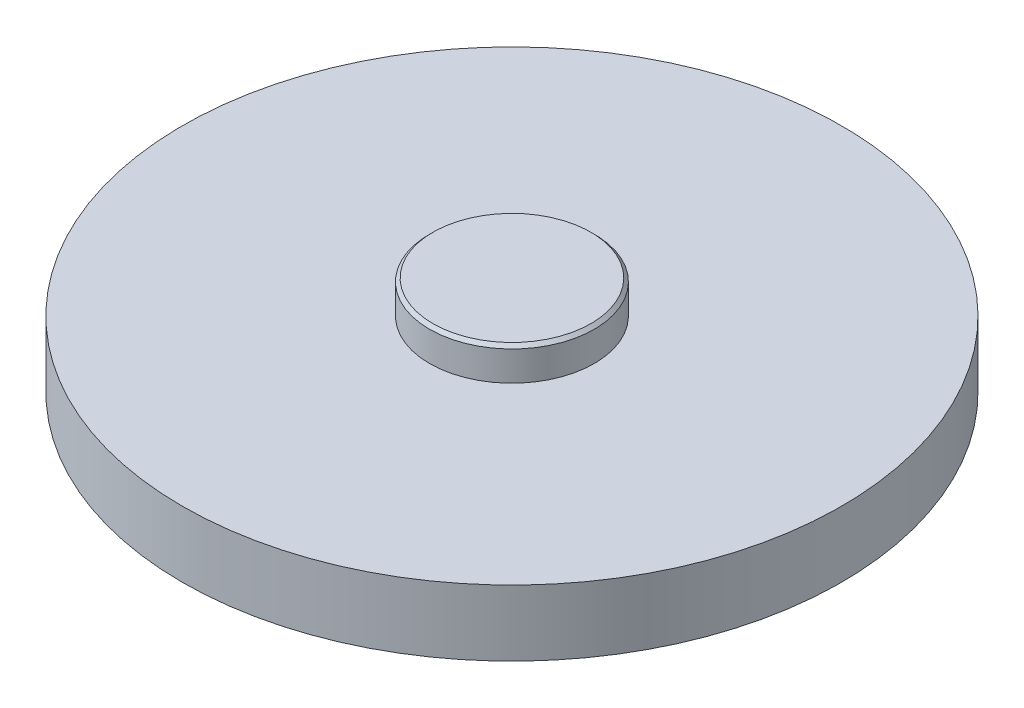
from build123d import *

# Parameters (mm, degrees)
ESQUISSE1_R        = 100
BOSS_EXTRU_1_DEPTH = 20
ESQUISSE2_R        = 25
BOSS_EXTRU_2_DEPTH = 10
CHANFREIN1_SIZE    = 1
ESQUISSE3_W        = 20
ESQUISSE3_H        = 40
BOSS_EXTRU_3_DEPTH = 20
CHANFREIN2_SIZE    = 1


with BuildPart() as part:
    # Esquisse1 → Boss.-Extru.1 (new body)
    with BuildSketch(Plane(origin=(0, 0, 0), x_dir=(1, 0, 0), z_dir=(0, 1, 0))):
        with Locations(Location((0, 0, 0), (0, 0, 270))):
            Circle(ESQUISSE1_R)
    extrude(amount=BOSS_EXTRU_1_DEPTH)

    # Esquisse2 → Boss.-Extru.2 (add)
    with BuildSketch(Plane(origin=(0, 20, 0), x_dir=(1, 0, 0), z_dir=(0, 1, 0))):
        with Locations(Location((0, 0, 0), (0, 0, 270))):
            Circle(ESQUISSE2_R)
    extrude(amount=BOSS_EXTRU_2_DEPTH)

    # Chanfrein1
    chanfrein1_edges = [part.edges().sort_by_distance(p)[0] for p in [
        (0, 30, -25),
    ]]
    chamfer(chanfrein1_edges, length=CHANFREIN1_SIZE)

    # Esquisse3 → Boss.-Extru.3 (add)
    with BuildSketch(Plane.XZ):
        Rectangle(ESQUISSE3_W, ESQUISSE3_H)
    extrude(amount=BOSS_EXTRU_3_DEPTH)

    # Chanfrein2
    chanfrein2_edges = [part.edges().sort_by_distance(p)[0] for p in [
        (-10, -20, 0),
        (0, -20, -20),
        (10, -20, 0),
        (0, -20, 20),
    ]]
    chamfer(chanfrein2_edges, length=CHANFREIN2_SIZE)


solid = part.part
